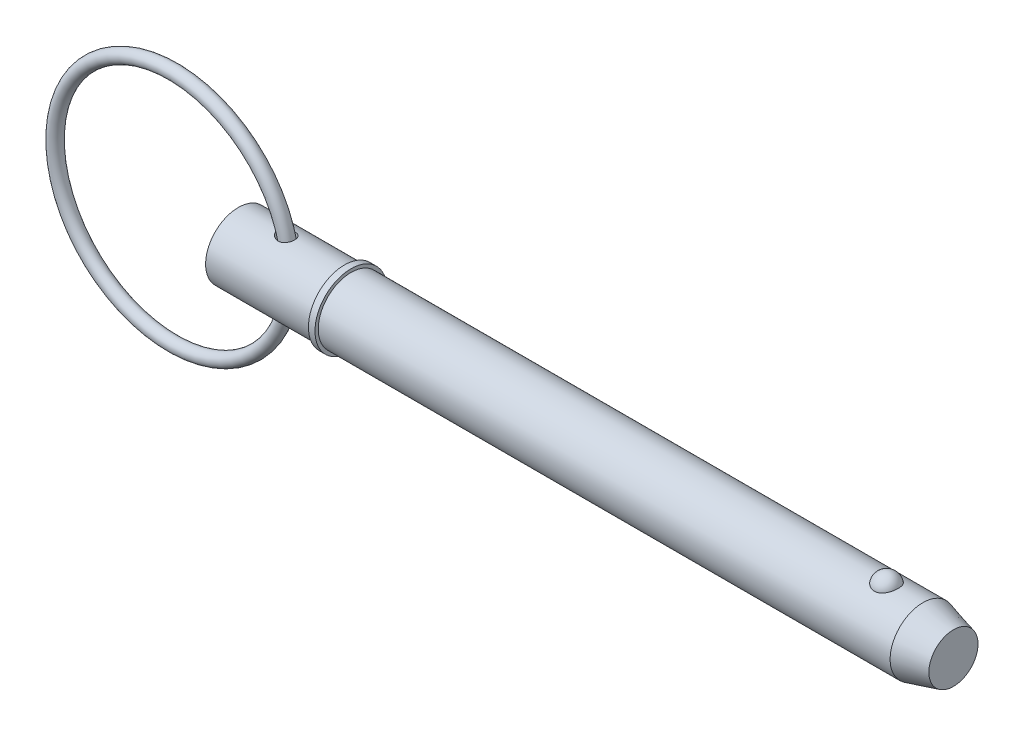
ISO-10303-21;
HEADER;
FILE_DESCRIPTION(('STEP AP214'),'2;1');
FILE_NAME('part.step','',(''),(''),'','','');
FILE_SCHEMA(('AUTOMOTIVE_DESIGN { 1 0 10303 214 1 1 1 1 }'));
ENDSEC;
DATA;
#1=APPLICATION_CONTEXT('core data for automotive mechanical design processes');
#2=APPLICATION_PROTOCOL_DEFINITION('international standard','automotive_design',2000,#1);
#3=PRODUCT_CONTEXT('',#1,'mechanical');
#4=PRODUCT('Part','Part','',(#3));
#5=PRODUCT_RELATED_PRODUCT_CATEGORY('part','',(#4));
#6=PRODUCT_DEFINITION_FORMATION('','',#4);
#7=PRODUCT_DEFINITION_CONTEXT('part definition',#1,'design');
#8=PRODUCT_DEFINITION('design','',#6,#7);
#9=PRODUCT_DEFINITION_SHAPE('','',#8);
#10=(LENGTH_UNIT() NAMED_UNIT(*) SI_UNIT(.MILLI.,.METRE.));
#11=(NAMED_UNIT(*) PLANE_ANGLE_UNIT() SI_UNIT($,.RADIAN.));
#12=(NAMED_UNIT(*) SI_UNIT($,.STERADIAN.) SOLID_ANGLE_UNIT());
#13=UNCERTAINTY_MEASURE_WITH_UNIT(LENGTH_MEASURE(1.E-05),#10,'distance_accuracy_value','');
#14=(GEOMETRIC_REPRESENTATION_CONTEXT(3) GLOBAL_UNCERTAINTY_ASSIGNED_CONTEXT((#13)) GLOBAL_UNIT_ASSIGNED_CONTEXT((#10,
#11,#12)) REPRESENTATION_CONTEXT('',''));
#15=CARTESIAN_POINT('',(0.,0.,0.));
#16=DIRECTION('',(0.,0.,1.));
#17=DIRECTION('',(1.,0.,0.));
#18=AXIS2_PLACEMENT_3D('',#15,#16,#17);
#19=CARTESIAN_POINT('',(-15.855506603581,0.,0.));
#20=DIRECTION('',(0.,0.,1.));
#21=DIRECTION('',(1.,0.,0.));
#22=AXIS2_PLACEMENT_3D('',#19,#20,#21);
#23=TOROIDAL_SURFACE('',#22,28.575,1.588);
#24=CARTESIAN_POINT('',(14.307493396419,0.,0.));
#25=VERTEX_POINT('',#24);
#26=VERTEX_LOOP('',#25);
#27=FACE_BOUND('',#26,.T.);
#28=ADVANCED_FACE('P0_F12',(#27),#23,.T.);
#29=CLOSED_SHELL('',(#28));
#30=MANIFOLD_SOLID_BREP('P0_B1',#29);
#31=CARTESIAN_POINT('',(0.,0.,0.));
#32=DIRECTION('',(1.,0.,0.));
#33=DIRECTION('',(0.,0.,-1.));
#34=AXIS2_PLACEMENT_3D('',#31,#32,#33);
#35=CYLINDRICAL_SURFACE('',#34,7.94);
#36=CARTESIAN_POINT('',(9.9064878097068,7.86092706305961,-1.11777712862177));
#37=CARTESIAN_POINT('',(9.98046148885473,7.84701054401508,-1.21564239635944));
#38=CARTESIAN_POINT('',(10.0632949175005,7.83217804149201,-1.30680329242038));
#39=CARTESIAN_POINT('',(10.243327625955,7.80247884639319,-1.47382688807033));
#40=CARTESIAN_POINT('',(10.3405572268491,7.78761214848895,-1.54965647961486));
#41=CARTESIAN_POINT('',(10.5460150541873,7.75960959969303,-1.6842723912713));
#42=CARTESIAN_POINT('',(10.654212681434,7.74646915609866,-1.74310445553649));
#43=CARTESIAN_POINT('',(10.8789333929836,7.72340979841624,-1.84259563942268));
#44=CARTESIAN_POINT('',(10.9954527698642,7.71348946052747,-1.88326279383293));
#45=CARTESIAN_POINT('',(11.2371543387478,7.69793327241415,-1.94589519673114));
#46=CARTESIAN_POINT('',(11.3624861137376,7.69242163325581,-1.96732022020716));
#47=CARTESIAN_POINT('',(11.6151110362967,7.68708151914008,-1.98809161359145));
#48=CARTESIAN_POINT('',(11.7424035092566,7.68725113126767,-1.98744541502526));
#49=CARTESIAN_POINT('',(11.9871377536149,7.69329740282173,-1.96389977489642));
#50=CARTESIAN_POINT('',(12.1047148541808,7.69883374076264,-1.94232728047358));
#51=CARTESIAN_POINT('',(12.3339179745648,7.7145667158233,-1.87886184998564));
#52=CARTESIAN_POINT('',(12.445546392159,7.72476145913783,-1.83697717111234));
#53=CARTESIAN_POINT('',(12.6521036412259,7.7477815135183,-1.73721211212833));
#54=CARTESIAN_POINT('',(12.7476463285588,7.76039274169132,-1.68054854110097));
#55=CARTESIAN_POINT('',(12.9274536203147,7.7871582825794,-1.55179691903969));
#56=CARTESIAN_POINT('',(13.0117191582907,7.8013124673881,-1.47971014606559));
#57=CARTESIAN_POINT('',(13.16544092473,7.82932755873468,-1.32341211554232));
#58=CARTESIAN_POINT('',(13.2351086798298,7.84318958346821,-1.23940873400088));
#59=CARTESIAN_POINT('',(13.3595610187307,7.86933512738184,-1.06080152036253));
#60=CARTESIAN_POINT('',(13.4143450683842,7.88161858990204,-0.966197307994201));
#61=CARTESIAN_POINT('',(13.5082288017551,7.90340571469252,-0.767990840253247));
#62=CARTESIAN_POINT('',(13.5471601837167,7.91287927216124,-0.664305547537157));
#63=CARTESIAN_POINT('',(13.6076213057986,7.92785679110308,-0.451705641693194));
#64=CARTESIAN_POINT('',(13.6291504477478,7.93336061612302,-0.342790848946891));
#65=CARTESIAN_POINT('',(13.6544025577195,7.93983472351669,-0.12204266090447));
#66=CARTESIAN_POINT('',(13.6580055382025,7.94077445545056,-0.0101946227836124));
#67=CARTESIAN_POINT('',(13.6469977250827,7.93793630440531,0.212542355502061));
#68=CARTESIAN_POINT('',(13.6323866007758,7.93415833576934,0.323431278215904));
#69=CARTESIAN_POINT('',(13.5852649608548,7.92228583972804,0.541194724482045));
#70=CARTESIAN_POINT('',(13.5527398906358,7.91418780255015,0.648065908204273));
#71=CARTESIAN_POINT('',(13.4705326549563,7.8945509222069,0.854658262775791));
#72=CARTESIAN_POINT('',(13.4208502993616,7.88301204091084,0.954379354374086));
#73=CARTESIAN_POINT('',(13.3056021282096,7.85778224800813,1.14366619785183));
#74=CARTESIAN_POINT('',(13.2400609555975,7.8440946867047,1.23324739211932));
#75=CARTESIAN_POINT('',(13.0946981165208,7.8160855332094,1.39984119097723));
#76=CARTESIAN_POINT('',(13.0148777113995,7.80176399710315,1.47685490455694));
#77=CARTESIAN_POINT('',(12.8438529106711,7.774237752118,1.61548556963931));
#78=CARTESIAN_POINT('',(12.7527554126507,7.76102428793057,1.67723263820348));
#79=CARTESIAN_POINT('',(12.5611987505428,7.73705789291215,1.78453696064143));
#80=CARTESIAN_POINT('',(12.4607407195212,7.72630466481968,1.83009617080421));
#81=CARTESIAN_POINT('',(12.2541997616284,7.70849465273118,1.90371822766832));
#82=CARTESIAN_POINT('',(12.1481665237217,7.7014098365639,1.93191408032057));
#83=CARTESIAN_POINT('',(11.9327851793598,7.69148605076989,1.97105353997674));
#84=CARTESIAN_POINT('',(11.8234367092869,7.68864754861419,1.98199524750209));
#85=CARTESIAN_POINT('',(11.6016024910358,7.68735890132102,1.98698770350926));
#86=CARTESIAN_POINT('',(11.4891069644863,7.68902083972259,1.98060702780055));
#87=CARTESIAN_POINT('',(11.2665484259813,7.6966276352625,1.95083303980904));
#88=CARTESIAN_POINT('',(11.1564861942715,7.70257384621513,1.92743434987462));
#89=CARTESIAN_POINT('',(10.9339966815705,7.71853798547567,1.86251478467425));
#90=CARTESIAN_POINT('',(10.8219140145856,7.72880438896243,1.81987394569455));
#91=CARTESIAN_POINT('',(10.6060441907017,7.75216432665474,1.7176403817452));
#92=CARTESIAN_POINT('',(10.5022611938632,7.76525926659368,1.65803922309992));
#93=CARTESIAN_POINT('',(10.3000447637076,7.79362794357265,1.51929354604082));
#94=CARTESIAN_POINT('',(10.2022480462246,7.80898310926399,1.43923272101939));
#95=CARTESIAN_POINT('',(10.0221668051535,7.83939672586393,1.26310118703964));
#96=CARTESIAN_POINT('',(9.93988168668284,7.85445518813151,1.16703109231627));
#97=CARTESIAN_POINT('',(9.79729823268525,7.88178950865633,0.964874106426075));
#98=CARTESIAN_POINT('',(9.73627994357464,7.89414970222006,0.859310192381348));
#99=CARTESIAN_POINT('',(9.63554001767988,7.91508909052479,0.638143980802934));
#100=CARTESIAN_POINT('',(9.59578986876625,7.92367334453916,0.522555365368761));
#101=CARTESIAN_POINT('',(9.54388714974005,7.93499161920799,0.300466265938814));
#102=CARTESIAN_POINT('',(9.52888458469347,7.93832727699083,0.194660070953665));
#103=CARTESIAN_POINT('',(9.51823078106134,7.94068976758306,-0.0179747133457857));
#104=CARTESIAN_POINT('',(9.52257317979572,7.93971801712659,-0.12480295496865));
#105=CARTESIAN_POINT('',(9.54911264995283,7.93386114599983,-0.326814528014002));
#106=CARTESIAN_POINT('',(9.56976509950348,7.92931471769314,-0.422217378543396));
#107=CARTESIAN_POINT('',(9.62591284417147,7.91721462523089,-0.608271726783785));
#108=CARTESIAN_POINT('',(9.66139801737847,7.90966301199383,-0.698926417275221));
#109=CARTESIAN_POINT('',(9.7317197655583,7.89515389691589,-0.844763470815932));
#110=CARTESIAN_POINT('',(9.76292633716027,7.88881879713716,-0.901801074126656));
#111=CARTESIAN_POINT('',(9.83075962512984,7.87538342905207,-1.01244242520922));
#112=CARTESIAN_POINT('',(9.86738597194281,7.86828321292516,-1.06604640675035));
#113=CARTESIAN_POINT('',(9.9064878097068,7.86092706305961,-1.11777712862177));
#114=B_SPLINE_CURVE_WITH_KNOTS('',3,(#36,#37,#38,#39,#40,#41,#42,#43,#44,#45,#46,#47,#48,#49,
#50,#51,#52,#53,#54,#55,#56,#57,#58,#59,#60,#61,#62,#63,#64,#65,#66,#67,#68,#69,#70,#71,#72,#73,
#74,#75,#76,#77,#78,#79,#80,#81,#82,#83,#84,#85,#86,#87,#88,#89,#90,#91,#92,#93,#94,#95,#96,#97,
#98,#99,#100,#101,#102,#103,#104,#105,#106,#107,#108,#109,#110,#111,#112,#113),.UNSPECIFIED.,
.T.,.F.,(4,2,2,2,2,2,2,2,2,2,2,2,2,2,2,2,2,2,2,2,2,2,2,2,2,2,2,2,2,2,2,2,2,2,2,2,2,2,4),(0.,
0.370138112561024,0.741067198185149,1.11098852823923,1.48074607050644,1.86058657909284,
2.24029919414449,2.59740885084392,2.95437345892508,3.2881332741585,3.6218654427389,
3.95036374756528,4.27887384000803,4.61078596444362,4.94270949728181,5.27685177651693,
5.61100012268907,5.94542035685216,6.27984429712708,6.61375187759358,6.94762997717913,
7.27855592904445,7.60944187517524,7.93776058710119,8.26611544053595,8.60272268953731,
8.93943635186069,9.29895306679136,9.65864886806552,10.0387340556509,10.4188046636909,
10.7843533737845,11.1494107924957,11.4683925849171,11.7872694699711,12.0791172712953,
12.3707662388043,12.5664313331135,12.7620830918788),.UNSPECIFIED.);
#115=CARTESIAN_POINT('',(9.9064878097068,7.86092706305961,-1.11777712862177));
#116=VERTEX_POINT('',#115);
#117=EDGE_CURVE('P1_E42',#116,#116,#114,.T.);
#118=ORIENTED_EDGE('',*,*,#117,.T.);
#119=EDGE_LOOP('',(#118));
#120=FACE_BOUND('',#119,.T.);
#121=CARTESIAN_POINT('',(0.,0.,0.));
#122=DIRECTION('',(1.,0.,0.));
#123=DIRECTION('',(0.,0.,-1.));
#124=AXIS2_PLACEMENT_3D('',#121,#122,#123);
#125=CIRCLE('',#124,7.94);
#126=CARTESIAN_POINT('',(0.,0.,-7.94));
#127=VERTEX_POINT('',#126);
#128=EDGE_CURVE('P1_E9',#127,#127,#125,.T.);
#129=ORIENTED_EDGE('',*,*,#128,.T.);
#130=EDGE_LOOP('',(#129));
#131=FACE_BOUND('',#130,.T.);
#132=CARTESIAN_POINT('',(25.722,0.,0.));
#133=DIRECTION('',(1.,0.,0.));
#134=DIRECTION('',(0.,0.,-1.));
#135=AXIS2_PLACEMENT_3D('',#132,#133,#134);
#136=CIRCLE('',#135,7.94);
#137=CARTESIAN_POINT('',(25.722,0.,-7.94));
#138=VERTEX_POINT('',#137);
#139=EDGE_CURVE('P1_E25',#138,#138,#136,.T.);
#140=ORIENTED_EDGE('',*,*,#139,.F.);
#141=EDGE_LOOP('',(#140));
#142=FACE_BOUND('',#141,.T.);
#143=CARTESIAN_POINT('',(9.9064878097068,-7.86092706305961,-1.11777712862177));
#144=CARTESIAN_POINT('',(9.84378768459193,-7.87272256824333,-1.03482250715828));
#145=CARTESIAN_POINT('',(9.7874122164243,-7.88386682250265,-0.947002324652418));
#146=CARTESIAN_POINT('',(9.68947008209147,-7.90377389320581,-0.763202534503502));
#147=CARTESIAN_POINT('',(9.64789384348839,-7.91253824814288,-0.667228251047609));
#148=CARTESIAN_POINT('',(9.58141396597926,-7.92676779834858,-0.468898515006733));
#149=CARTESIAN_POINT('',(9.55658638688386,-7.93221793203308,-0.366516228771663));
#150=CARTESIAN_POINT('',(9.525398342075,-7.9390896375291,-0.158837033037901));
#151=CARTESIAN_POINT('',(9.51903196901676,-7.94051249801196,-0.0535410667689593));
#152=CARTESIAN_POINT('',(9.5249639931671,-7.93919670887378,0.149856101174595));
#153=CARTESIAN_POINT('',(9.53611757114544,-7.9367132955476,0.247994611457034));
#154=CARTESIAN_POINT('',(9.57435037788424,-7.92833496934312,0.440949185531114));
#155=CARTESIAN_POINT('',(9.60143086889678,-7.92243978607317,0.535764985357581));
#156=CARTESIAN_POINT('',(9.67027872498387,-7.90782830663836,0.720026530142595));
#157=CARTESIAN_POINT('',(9.71210005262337,-7.89910165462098,0.809451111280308));
#158=CARTESIAN_POINT('',(9.80864905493,-7.87966534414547,0.980775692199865));
#159=CARTESIAN_POINT('',(9.86338092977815,-7.86895504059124,1.06267323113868));
#160=CARTESIAN_POINT('',(9.99009906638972,-7.84531573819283,1.22559225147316));
#161=CARTESIAN_POINT('',(10.0632770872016,-7.8322718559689,1.30566871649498));
#162=CARTESIAN_POINT('',(10.2208237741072,-7.80611237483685,1.45392159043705));
#163=CARTESIAN_POINT('',(10.3051986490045,-7.79299674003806,1.52209134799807));
#164=CARTESIAN_POINT('',(10.4935539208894,-7.76638841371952,1.65280871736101));
#165=CARTESIAN_POINT('',(10.5986730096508,-7.75303312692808,1.71374951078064));
#166=CARTESIAN_POINT('',(10.8175805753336,-7.72920597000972,1.81820073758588));
#167=CARTESIAN_POINT('',(10.9313721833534,-7.71873514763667,1.86170483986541));
#168=CARTESIAN_POINT('',(11.1696833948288,-7.70161777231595,1.93133079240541));
#169=CARTESIAN_POINT('',(11.2944525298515,-7.69514907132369,1.95665138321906));
#170=CARTESIAN_POINT('',(11.5466607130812,-7.6877908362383,1.98537345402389));
#171=CARTESIAN_POINT('',(11.6740986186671,-7.68689896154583,1.98878412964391));
#172=CARTESIAN_POINT('',(11.9206005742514,-7.690938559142,1.97309854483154));
#173=CARTESIAN_POINT('',(12.0397453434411,-7.69555832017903,1.95520713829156));
#174=CARTESIAN_POINT('',(12.2727177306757,-7.70968728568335,1.89872693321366));
#175=CARTESIAN_POINT('',(12.3865475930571,-7.71919440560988,1.86014695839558));
#176=CARTESIAN_POINT('',(12.5975118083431,-7.74115679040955,1.76641559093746));
#177=CARTESIAN_POINT('',(12.6952552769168,-7.75336701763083,1.71257254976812));
#178=CARTESIAN_POINT('',(12.8798510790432,-7.77962828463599,1.58901145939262));
#179=CARTESIAN_POINT('',(12.9667044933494,-7.79367914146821,1.51929498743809));
#180=CARTESIAN_POINT('',(13.1254818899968,-7.82172079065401,1.36751778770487));
#181=CARTESIAN_POINT('',(13.1976693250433,-7.83570718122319,1.28573131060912));
#182=CARTESIAN_POINT('',(13.3274495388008,-7.86236718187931,1.11111271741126));
#183=CARTESIAN_POINT('',(13.3850418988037,-7.87504075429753,1.01828028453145));
#184=CARTESIAN_POINT('',(13.4847470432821,-7.89782512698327,0.823214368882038));
#185=CARTESIAN_POINT('',(13.5267056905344,-7.90791011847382,0.720899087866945));
#186=CARTESIAN_POINT('',(13.5933891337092,-7.92427335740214,0.510509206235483));
#187=CARTESIAN_POINT('',(13.6181132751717,-7.9305514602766,0.402434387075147));
#188=CARTESIAN_POINT('',(13.6498843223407,-7.93866355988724,0.182728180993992));
#189=CARTESIAN_POINT('',(13.6567982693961,-7.94046412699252,0.07107630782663));
#190=CARTESIAN_POINT('',(13.6524060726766,-7.93933046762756,-0.151845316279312));
#191=CARTESIAN_POINT('',(13.6410996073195,-7.93639615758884,-0.26311506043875));
#192=CARTESIAN_POINT('',(13.6005023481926,-7.92610202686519,-0.482238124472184));
#193=CARTESIAN_POINT('',(13.571192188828,-7.91873744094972,-0.590087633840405));
#194=CARTESIAN_POINT('',(13.495246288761,-7.90037565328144,-0.799178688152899));
#195=CARTESIAN_POINT('',(13.4486102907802,-7.88937839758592,-0.900420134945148));
#196=CARTESIAN_POINT('',(13.3391817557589,-7.86497175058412,-1.09328280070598));
#197=CARTESIAN_POINT('',(13.2764083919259,-7.85156522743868,-1.18491525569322));
#198=CARTESIAN_POINT('',(13.1362355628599,-7.8238261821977,-1.35604994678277));
#199=CARTESIAN_POINT('',(13.0588372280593,-7.80949373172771,-1.43555311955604));
#200=CARTESIAN_POINT('',(12.8921392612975,-7.78164292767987,-1.57955181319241));
#201=CARTESIAN_POINT('',(12.8029410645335,-7.76811892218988,-1.64416363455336));
#202=CARTESIAN_POINT('',(12.6146622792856,-7.74328422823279,-1.75742016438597));
#203=CARTESIAN_POINT('',(12.5155829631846,-7.73197325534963,-1.80606692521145));
#204=CARTESIAN_POINT('',(12.31135301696,-7.71289290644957,-1.88588502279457));
#205=CARTESIAN_POINT('',(12.2062651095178,-7.70509254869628,-1.91720981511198));
#206=CARTESIAN_POINT('',(11.9922253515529,-7.69365188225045,-1.96261878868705));
#207=CARTESIAN_POINT('',(11.8832731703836,-7.69001193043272,-1.97670149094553));
#208=CARTESIAN_POINT('',(11.662174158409,-7.6871142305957,-1.98794112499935));
#209=CARTESIAN_POINT('',(11.5500082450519,-7.6879499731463,-1.98473694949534));
#210=CARTESIAN_POINT('',(11.3276038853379,-7.69396349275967,-1.96129119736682));
#211=CARTESIAN_POINT('',(11.2173659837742,-7.6991424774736,-1.94104488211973));
#212=CARTESIAN_POINT('',(10.9943151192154,-7.71363470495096,-1.8826578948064));
#213=CARTESIAN_POINT('',(10.8818004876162,-7.72319478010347,-1.8434396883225));
#214=CARTESIAN_POINT('',(10.6644693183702,-7.74534199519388,-1.74804607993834));
#215=CARTESIAN_POINT('',(10.5596578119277,-7.75793109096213,-1.69185971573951));
#216=CARTESIAN_POINT('',(10.3538333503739,-7.78563853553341,-1.5595801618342));
#217=CARTESIAN_POINT('',(10.2535123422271,-7.80086820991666,-1.48242881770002));
#218=CARTESIAN_POINT('',(10.0678634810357,-7.83136022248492,-1.31182139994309));
#219=CARTESIAN_POINT('',(9.98252491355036,-7.84662252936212,-1.21837707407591));
#220=CARTESIAN_POINT('',(9.9064878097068,-7.86092706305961,-1.11777712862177));
#221=B_SPLINE_CURVE_WITH_KNOTS('',3,(#143,#144,#145,#146,#147,#148,#149,#150,#151,#152,#153,
#154,#155,#156,#157,#158,#159,#160,#161,#162,#163,#164,#165,#166,#167,#168,#169,#170,#171,#172,
#173,#174,#175,#176,#177,#178,#179,#180,#181,#182,#183,#184,#185,#186,#187,#188,#189,#190,#191,
#192,#193,#194,#195,#196,#197,#198,#199,#200,#201,#202,#203,#204,#205,#206,#207,#208,#209,#210,
#211,#212,#213,#214,#215,#216,#217,#218,#219,#220),.UNSPECIFIED.,.T.,.F.,(4,2,2,2,2,2,2,2,2,2,2,
2,2,2,2,2,2,2,2,2,2,2,2,2,2,2,2,2,2,2,2,2,2,2,2,2,2,2,4),(0.,0.313593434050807,
0.626983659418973,0.941787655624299,1.25649090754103,1.55146990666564,1.84647228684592,
2.14256601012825,2.4387561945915,2.76521830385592,3.09186220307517,3.45696288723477,
3.82219601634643,4.20267276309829,4.58298981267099,4.94277962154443,5.30241610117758,
5.63754619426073,5.97264300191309,6.301049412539,6.62946524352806,6.96103833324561,
7.29262401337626,7.62667800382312,7.96073789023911,8.29515773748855,8.6295825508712,
8.96361184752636,9.29761533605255,9.62891449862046,9.96017105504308,10.288443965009,
10.616745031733,10.951930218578,11.2872086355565,11.6442788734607,12.0015802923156,
12.3821516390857,12.762449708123),.UNSPECIFIED.);
#222=CARTESIAN_POINT('',(9.9064878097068,-7.86092706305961,-1.11777712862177));
#223=VERTEX_POINT('',#222);
#224=EDGE_CURVE('P1_E17',#223,#223,#221,.T.);
#225=ORIENTED_EDGE('',*,*,#224,.T.);
#226=EDGE_LOOP('',(#225));
#227=FACE_BOUND('',#226,.T.);
#228=ADVANCED_FACE('P1_F13',(#120,#131,#142,#227),#35,.T.);
#229=CARTESIAN_POINT('',(0.,0.,0.));
#230=DIRECTION('',(1.,0.,0.));
#231=DIRECTION('',(0.,0.,-1.));
#232=AXIS2_PLACEMENT_3D('',#229,#230,#231);
#233=CYLINDRICAL_SURFACE('',#232,7.94);
#234=CARTESIAN_POINT('',(165.951879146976,0.,0.));
#235=DIRECTION('',(1.,0.,0.));
#236=DIRECTION('',(0.,0.,-1.));
#237=AXIS2_PLACEMENT_3D('',#234,#235,#236);
#238=CIRCLE('',#237,7.94);
#239=CARTESIAN_POINT('',(165.951879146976,0.,-7.94));
#240=VERTEX_POINT('',#239);
#241=EDGE_CURVE('P1_E99',#240,#240,#238,.T.);
#242=ORIENTED_EDGE('',*,*,#241,.F.);
#243=EDGE_LOOP('',(#242));
#244=FACE_BOUND('',#243,.T.);
#245=CARTESIAN_POINT('',(27.31,0.,0.));
#246=DIRECTION('',(1.,0.,0.));
#247=DIRECTION('',(0.,0.,-1.));
#248=AXIS2_PLACEMENT_3D('',#245,#246,#247);
#249=CIRCLE('',#248,7.94);
#250=CARTESIAN_POINT('',(27.31,0.,-7.94));
#251=VERTEX_POINT('',#250);
#252=EDGE_CURVE('P1_E96',#251,#251,#249,.T.);
#253=ORIENTED_EDGE('',*,*,#252,.T.);
#254=EDGE_LOOP('',(#253));
#255=FACE_BOUND('',#254,.T.);
#256=CARTESIAN_POINT('',(157.144907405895,7.37767842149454,2.93486986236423));
#257=CARTESIAN_POINT('',(156.992749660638,7.3776732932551,2.93487505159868));
#258=CARTESIAN_POINT('',(156.840632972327,7.38258419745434,2.92262454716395));
#259=CARTESIAN_POINT('',(156.540928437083,7.40163229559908,2.87404196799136));
#260=CARTESIAN_POINT('',(156.393339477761,7.41576720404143,2.83771585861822));
#261=CARTESIAN_POINT('',(156.107018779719,7.45161576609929,2.74218769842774));
#262=CARTESIAN_POINT('',(155.968274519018,7.47331841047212,2.68301886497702));
#263=CARTESIAN_POINT('',(155.702882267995,7.52194082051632,2.54350967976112));
#264=CARTESIAN_POINT('',(155.576236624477,7.54886159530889,2.46316523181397));
#265=CARTESIAN_POINT('',(155.334534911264,7.60594671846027,2.28090375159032));
#266=CARTESIAN_POINT('',(155.219906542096,7.63618114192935,2.1784421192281));
#267=CARTESIAN_POINT('',(155.008878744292,7.69614046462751,1.95608495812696));
#268=CARTESIAN_POINT('',(154.912482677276,7.72586526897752,1.83618622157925));
#269=CARTESIAN_POINT('',(154.735938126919,7.78314821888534,1.57628086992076));
#270=CARTESIAN_POINT('',(154.656707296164,7.81055035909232,1.43561546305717));
#271=CARTESIAN_POINT('',(154.521797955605,7.85879631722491,1.14236334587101));
#272=CARTESIAN_POINT('',(154.466121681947,7.87963951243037,0.989775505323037));
#273=CARTESIAN_POINT('',(154.37881215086,7.91289645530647,0.674619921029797));
#274=CARTESIAN_POINT('',(154.34753090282,7.92518652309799,0.511941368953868));
#275=CARTESIAN_POINT('',(154.310975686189,7.93958930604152,0.183247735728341));
#276=CARTESIAN_POINT('',(154.305701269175,7.94170219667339,0.0172327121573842));
#277=CARTESIAN_POINT('',(154.321231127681,7.93554931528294,-0.312672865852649));
#278=CARTESIAN_POINT('',(154.341925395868,7.92732732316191,-0.476569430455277));
#279=CARTESIAN_POINT('',(154.40878655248,7.90141534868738,-0.79830524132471));
#280=CARTESIAN_POINT('',(154.454953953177,7.88372517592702,-0.956144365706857));
#281=CARTESIAN_POINT('',(154.571898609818,7.84066230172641,-1.26152073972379));
#282=CARTESIAN_POINT('',(154.642704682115,7.81528060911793,-1.40904568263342));
#283=CARTESIAN_POINT('',(154.807478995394,7.75948672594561,-1.68950598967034));
#284=CARTESIAN_POINT('',(154.901448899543,7.72907417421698,-1.82244030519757));
#285=CARTESIAN_POINT('',(155.110839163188,7.66640424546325,-2.07032792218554));
#286=CARTESIAN_POINT('',(155.226315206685,7.63414223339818,-2.18523308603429));
#287=CARTESIAN_POINT('',(155.4759006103,7.57149681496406,-2.39329737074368));
#288=CARTESIAN_POINT('',(155.610008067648,7.54111321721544,-2.48645870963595));
#289=CARTESIAN_POINT('',(155.890111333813,7.48650742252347,-2.64628132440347));
#290=CARTESIAN_POINT('',(156.035760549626,7.46215900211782,-2.71350554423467));
#291=CARTESIAN_POINT('',(156.337425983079,7.42171253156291,-2.82226614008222));
#292=CARTESIAN_POINT('',(156.493438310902,7.40561140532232,-2.86381209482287));
#293=CARTESIAN_POINT('',(156.802970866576,7.3842679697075,-2.9183907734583));
#294=CARTESIAN_POINT('',(156.956222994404,7.37852109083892,-2.93275024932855));
#295=CARTESIAN_POINT('',(157.263070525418,7.37700973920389,-2.93655208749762));
#296=CARTESIAN_POINT('',(157.416665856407,7.38124333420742,-2.92599927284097));
#297=CARTESIAN_POINT('',(157.714990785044,7.39890635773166,-2.88102897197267));
#298=CARTESIAN_POINT('',(157.859848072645,7.41205491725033,-2.84733999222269));
#299=CARTESIAN_POINT('',(158.14164329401,7.445801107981,-2.75788206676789));
#300=CARTESIAN_POINT('',(158.278580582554,7.46639934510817,-2.70211132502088));
#301=CARTESIAN_POINT('',(158.544061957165,7.51339098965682,-2.56858908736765));
#302=CARTESIAN_POINT('',(158.672354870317,7.53990200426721,-2.4903806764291));
#303=CARTESIAN_POINT('',(158.914244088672,7.59569503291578,-2.31462737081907));
#304=CARTESIAN_POINT('',(159.027837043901,7.6249776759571,-2.21707808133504));
#305=CARTESIAN_POINT('',(159.24322156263,7.68489473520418,-1.99982049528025));
#306=CARTESIAN_POINT('',(159.344148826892,7.71552419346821,-1.87925337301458));
#307=CARTESIAN_POINT('',(159.525186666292,7.77353016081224,-1.6226882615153));
#308=CARTESIAN_POINT('',(159.605293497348,7.80090608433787,-1.48668750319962));
#309=CARTESIAN_POINT('',(159.745361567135,7.85047992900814,-1.1981841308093));
#310=CARTESIAN_POINT('',(159.804587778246,7.87248183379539,-1.04529016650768));
#311=CARTESIAN_POINT('',(159.897982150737,7.90785114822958,-0.731080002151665));
#312=CARTESIAN_POINT('',(159.932149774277,7.92121837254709,-0.569763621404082));
#313=CARTESIAN_POINT('',(159.974795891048,7.93797834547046,-0.242812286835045));
#314=CARTESIAN_POINT('',(159.983204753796,7.94134405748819,-0.0771668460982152));
#315=CARTESIAN_POINT('',(159.973962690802,7.93767937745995,0.253276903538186));
#316=CARTESIAN_POINT('',(159.956312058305,7.93064910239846,0.418075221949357));
#317=CARTESIAN_POINT('',(159.895424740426,7.90695571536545,0.741525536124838));
#318=CARTESIAN_POINT('',(159.852281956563,7.8903279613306,0.900197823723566));
#319=CARTESIAN_POINT('',(159.74135358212,7.84916386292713,1.20759654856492));
#320=CARTESIAN_POINT('',(159.67356656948,7.82462706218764,1.35632241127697));
#321=CARTESIAN_POINT('',(159.514371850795,7.77006699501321,1.64032869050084));
#322=CARTESIAN_POINT('',(159.422861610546,7.74002008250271,1.7755471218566));
#323=CARTESIAN_POINT('',(159.218296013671,7.67774175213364,2.0280064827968));
#324=CARTESIAN_POINT('',(159.105241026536,7.64551037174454,2.14524772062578));
#325=CARTESIAN_POINT('',(158.860831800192,7.58265895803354,2.35778002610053));
#326=CARTESIAN_POINT('',(158.729583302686,7.5520309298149,2.45319004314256));
#327=CARTESIAN_POINT('',(158.451601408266,7.49579792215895,2.61999897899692));
#328=CARTESIAN_POINT('',(158.304867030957,7.4701932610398,2.69139637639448));
#329=CARTESIAN_POINT('',(157.992947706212,7.42622216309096,2.8105324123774));
#330=CARTESIAN_POINT('',(157.827220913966,7.40825002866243,2.85700910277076));
#331=CARTESIAN_POINT('',(157.489279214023,7.38398348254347,2.9191685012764));
#332=CARTESIAN_POINT('',(157.31706702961,7.3776842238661,2.93486399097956));
#333=CARTESIAN_POINT('',(157.144907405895,7.37767842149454,2.93486986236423));
#334=B_SPLINE_CURVE_WITH_KNOTS('',3,(#256,#257,#258,#259,#260,#261,#262,#263,#264,#265,#266,
#267,#268,#269,#270,#271,#272,#273,#274,#275,#276,#277,#278,#279,#280,#281,#282,#283,#284,#285,
#286,#287,#288,#289,#290,#291,#292,#293,#294,#295,#296,#297,#298,#299,#300,#301,#302,#303,#304,
#305,#306,#307,#308,#309,#310,#311,#312,#313,#314,#315,#316,#317,#318,#319,#320,#321,#322,#323,
#324,#325,#326,#327,#328,#329,#330,#331,#332,#333),.UNSPECIFIED.,.T.,.F.,(4,2,2,2,2,2,2,2,2,2,2,
2,2,2,2,2,2,2,2,2,2,2,2,2,2,2,2,2,2,2,2,2,2,2,2,2,2,2,4),(0.,0.455841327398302,
0.911569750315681,1.36663794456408,1.82179423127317,2.2897898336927,2.75787163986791,
3.24685368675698,3.73588214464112,4.23184282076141,4.72779494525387,5.22165321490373,
5.71552141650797,6.20996917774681,6.7044524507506,7.20023431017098,7.69596557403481,
8.18023418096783,8.66432203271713,9.12410697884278,9.58380291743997,10.0296503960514,
10.4755341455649,10.9312349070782,11.3870393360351,11.8654416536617,12.3439299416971,
12.8378875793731,13.3318558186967,13.8271581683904,14.3224549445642,14.8159385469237,
15.3094506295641,15.8051323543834,16.3008055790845,16.7937101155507,17.2866458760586,
17.8026240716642,18.3183879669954),.UNSPECIFIED.);
#335=CARTESIAN_POINT('',(157.144907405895,7.37767842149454,2.93486986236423));
#336=VERTEX_POINT('',#335);
#337=EDGE_CURVE('P1_E34',#336,#336,#334,.T.);
#338=ORIENTED_EDGE('',*,*,#337,.T.);
#339=EDGE_LOOP('',(#338));
#340=FACE_BOUND('',#339,.T.);
#341=ADVANCED_FACE('P1_F46',(#244,#255,#340),#233,.T.);
#342=CARTESIAN_POINT('',(0.,0.,0.));
#343=DIRECTION('',(-1.,0.,0.));
#344=DIRECTION('',(0.,0.,1.));
#345=AXIS2_PLACEMENT_3D('',#342,#343,#344);
#346=PLANE('',#345);
#347=ORIENTED_EDGE('',*,*,#128,.F.);
#348=EDGE_LOOP('',(#347));
#349=FACE_BOUND('',#348,.T.);
#350=ADVANCED_FACE('P1_F15',(#349),#346,.T.);
#351=CARTESIAN_POINT('',(25.722,7.94,0.));
#352=DIRECTION('',(-1.,0.,0.));
#353=DIRECTION('',(0.,0.,1.));
#354=AXIS2_PLACEMENT_3D('',#351,#352,#353);
#355=PLANE('',#354);
#356=ORIENTED_EDGE('',*,*,#139,.T.);
#357=EDGE_LOOP('',(#356));
#358=FACE_BOUND('',#357,.T.);
#359=CARTESIAN_POINT('',(25.722,0.,0.));
#360=DIRECTION('',(1.,0.,0.));
#361=DIRECTION('',(0.,0.,-1.));
#362=AXIS2_PLACEMENT_3D('',#359,#360,#361);
#363=CIRCLE('',#362,8.734);
#364=CARTESIAN_POINT('',(25.722,0.,-8.734));
#365=VERTEX_POINT('',#364);
#366=EDGE_CURVE('P1_E30',#365,#365,#363,.T.);
#367=ORIENTED_EDGE('',*,*,#366,.F.);
#368=EDGE_LOOP('',(#367));
#369=FACE_BOUND('',#368,.T.);
#370=ADVANCED_FACE('P1_F81',(#358,#369),#355,.T.);
#371=CARTESIAN_POINT('',(0.,0.,0.));
#372=DIRECTION('',(1.,0.,0.));
#373=DIRECTION('',(0.,0.,-1.));
#374=AXIS2_PLACEMENT_3D('',#371,#372,#373);
#375=CYLINDRICAL_SURFACE('',#374,8.734);
#376=ORIENTED_EDGE('',*,*,#366,.T.);
#377=EDGE_LOOP('',(#376));
#378=FACE_BOUND('',#377,.T.);
#379=CARTESIAN_POINT('',(27.31,0.,0.));
#380=DIRECTION('',(1.,0.,0.));
#381=DIRECTION('',(0.,0.,-1.));
#382=AXIS2_PLACEMENT_3D('',#379,#380,#381);
#383=CIRCLE('',#382,8.734);
#384=CARTESIAN_POINT('',(27.31,0.,-8.734));
#385=VERTEX_POINT('',#384);
#386=EDGE_CURVE('P1_E95',#385,#385,#383,.T.);
#387=ORIENTED_EDGE('',*,*,#386,.F.);
#388=EDGE_LOOP('',(#387));
#389=FACE_BOUND('',#388,.T.);
#390=ADVANCED_FACE('P1_F68',(#378,#389),#375,.T.);
#391=CARTESIAN_POINT('',(27.31,8.734,0.));
#392=DIRECTION('',(1.,0.,0.));
#393=DIRECTION('',(0.,0.,-1.));
#394=AXIS2_PLACEMENT_3D('',#391,#392,#393);
#395=PLANE('',#394);
#396=ORIENTED_EDGE('',*,*,#386,.T.);
#397=EDGE_LOOP('',(#396));
#398=FACE_BOUND('',#397,.T.);
#399=ORIENTED_EDGE('',*,*,#252,.F.);
#400=EDGE_LOOP('',(#399));
#401=FACE_BOUND('',#400,.T.);
#402=ADVANCED_FACE('P1_F62',(#398,#401),#395,.T.);
#403=CARTESIAN_POINT('',(173.36,0.,0.));
#404=DIRECTION('',(-1.,0.,0.));
#405=DIRECTION('',(0.,0.,1.));
#406=AXIS2_PLACEMENT_3D('',#403,#404,#405);
#407=CONICAL_SURFACE('',#406,5.95500000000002,0.261799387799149);
#408=ORIENTED_EDGE('',*,*,#241,.T.);
#409=EDGE_LOOP('',(#408));
#410=FACE_BOUND('',#409,.T.);
#411=CARTESIAN_POINT('',(173.36,0.,0.));
#412=DIRECTION('',(1.,0.,0.));
#413=DIRECTION('',(0.,0.,-1.));
#414=AXIS2_PLACEMENT_3D('',#411,#412,#413);
#415=CIRCLE('',#414,5.95500000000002);
#416=CARTESIAN_POINT('',(173.36,0.,-5.95500000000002));
#417=VERTEX_POINT('',#416);
#418=EDGE_CURVE('P1_E41',#417,#417,#415,.T.);
#419=ORIENTED_EDGE('',*,*,#418,.F.);
#420=EDGE_LOOP('',(#419));
#421=FACE_BOUND('',#420,.T.);
#422=ADVANCED_FACE('P1_F59',(#410,#421),#407,.T.);
#423=CARTESIAN_POINT('',(173.36,5.95500000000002,0.));
#424=DIRECTION('',(1.,0.,0.));
#425=DIRECTION('',(0.,0.,-1.));
#426=AXIS2_PLACEMENT_3D('',#423,#424,#425);
#427=PLANE('',#426);
#428=ORIENTED_EDGE('',*,*,#418,.T.);
#429=EDGE_LOOP('',(#428));
#430=FACE_BOUND('',#429,.T.);
#431=ADVANCED_FACE('P1_F55',(#430),#427,.T.);
#432=CARTESIAN_POINT('',(157.144907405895,7.146,0.));
#433=DIRECTION('',(-1.,0.,0.));
#434=DIRECTION('',(0.,1.,0.));
#435=AXIS2_PLACEMENT_3D('',#432,#433,#434);
#436=SPHERICAL_SURFACE('',#435,2.944);
#437=ORIENTED_EDGE('',*,*,#337,.F.);
#438=EDGE_LOOP('',(#437));
#439=FACE_BOUND('',#438,.T.);
#440=ADVANCED_FACE('P1_F50',(#439),#436,.T.);
#441=CARTESIAN_POINT('',(-15.855506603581,0.,0.));
#442=DIRECTION('',(0.,0.,1.));
#443=DIRECTION('',(1.,0.,0.));
#444=AXIS2_PLACEMENT_3D('',#441,#442,#443);
#445=TOROIDAL_SURFACE('',#444,28.575,1.985);
#446=ORIENTED_EDGE('',*,*,#224,.F.);
#447=EDGE_LOOP('',(#446));
#448=FACE_BOUND('',#447,.T.);
#449=ORIENTED_EDGE('',*,*,#117,.F.);
#450=EDGE_LOOP('',(#449));
#451=FACE_BOUND('',#450,.T.);
#452=ADVANCED_FACE('P1_F54',(#448,#451),#445,.F.);
#453=CLOSED_SHELL('',(#228,#341,#350,#370,#390,#402,#422,#431,#440,#452));
#454=MANIFOLD_SOLID_BREP('P1_B1',#453);
#455=ADVANCED_BREP_SHAPE_REPRESENTATION('',(#18,#30,#454),#14);
#456=SHAPE_DEFINITION_REPRESENTATION(#9,#455);
ENDSEC;
END-ISO-10303-21;
